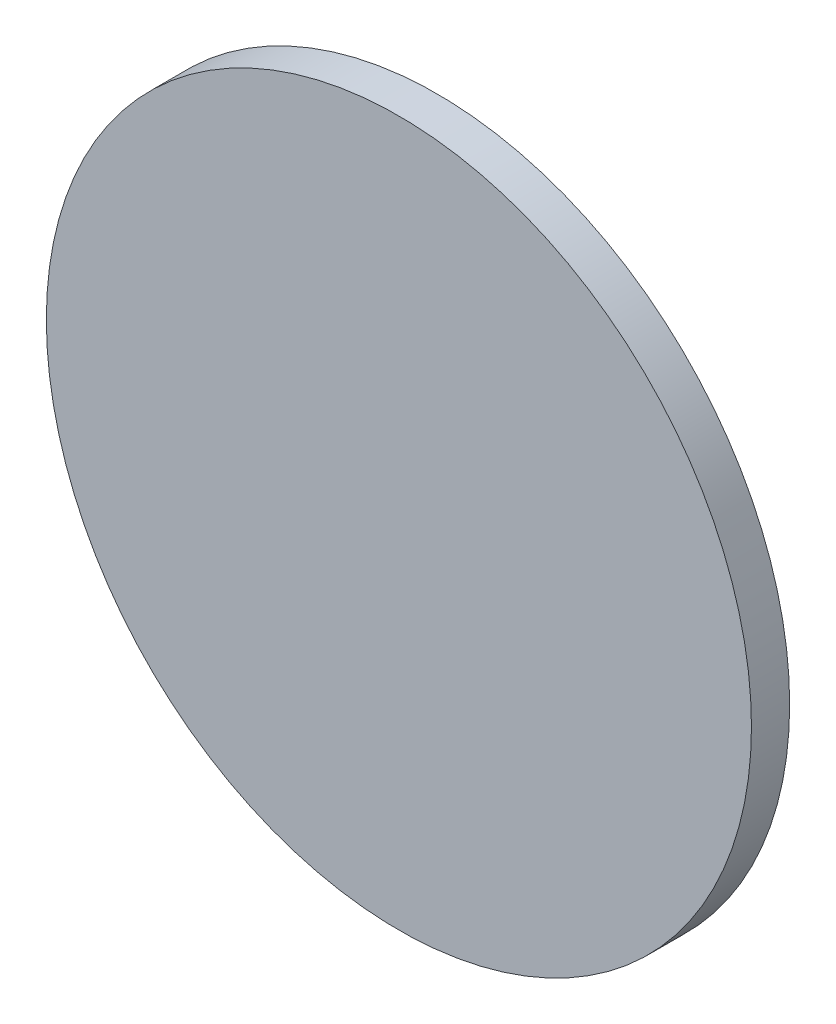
from build123d import *

# Parameters (mm, degrees)
SKETCH1_R      = 46.139008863
EXTRUDE1_DEPTH = 5


with BuildPart() as part:
    # Sketch1 → Extrude1 (new body)
    with BuildSketch(Plane.XY):
        Circle(SKETCH1_R)
    extrude(amount=EXTRUDE1_DEPTH)


solid = part.part
